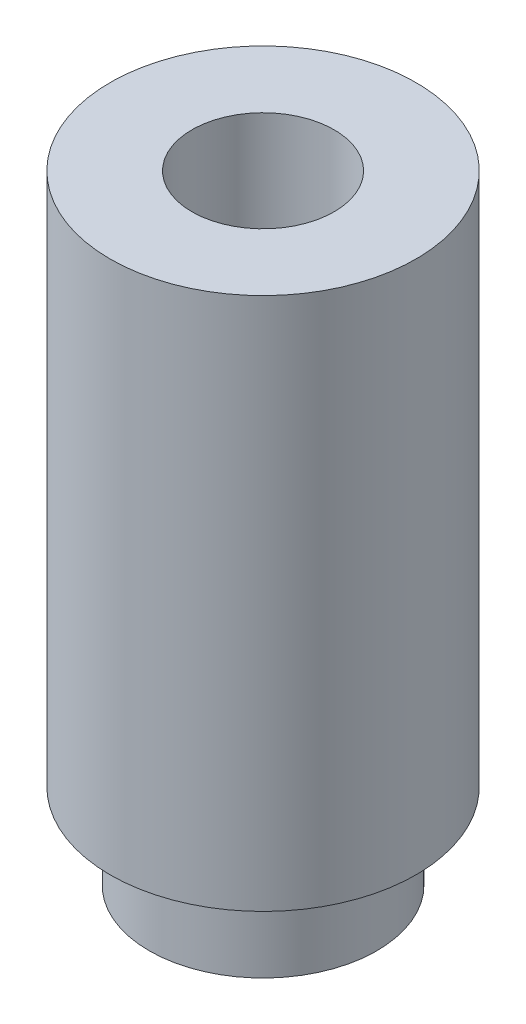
from build123d import *


with BuildPart() as part:
    # Sketch2 → Revolve1 (revolve)
    with BuildSketch(Plane.XY, mode=Mode.PRIVATE) as revolve1_sk:
        Polygon((1, 7.5), (2.15, 7.5), (2.15, 0), (1.6, 0), (1.6, -1.2), (1, -1.2), align=None)
    revolve(revolve1_sk.sketch.rotate(Axis((0, 7.5, 0), (0, -1, 0)), 90), axis=Axis((0, 7.5, 0), (0, -1, 0)))


solid = part.part
